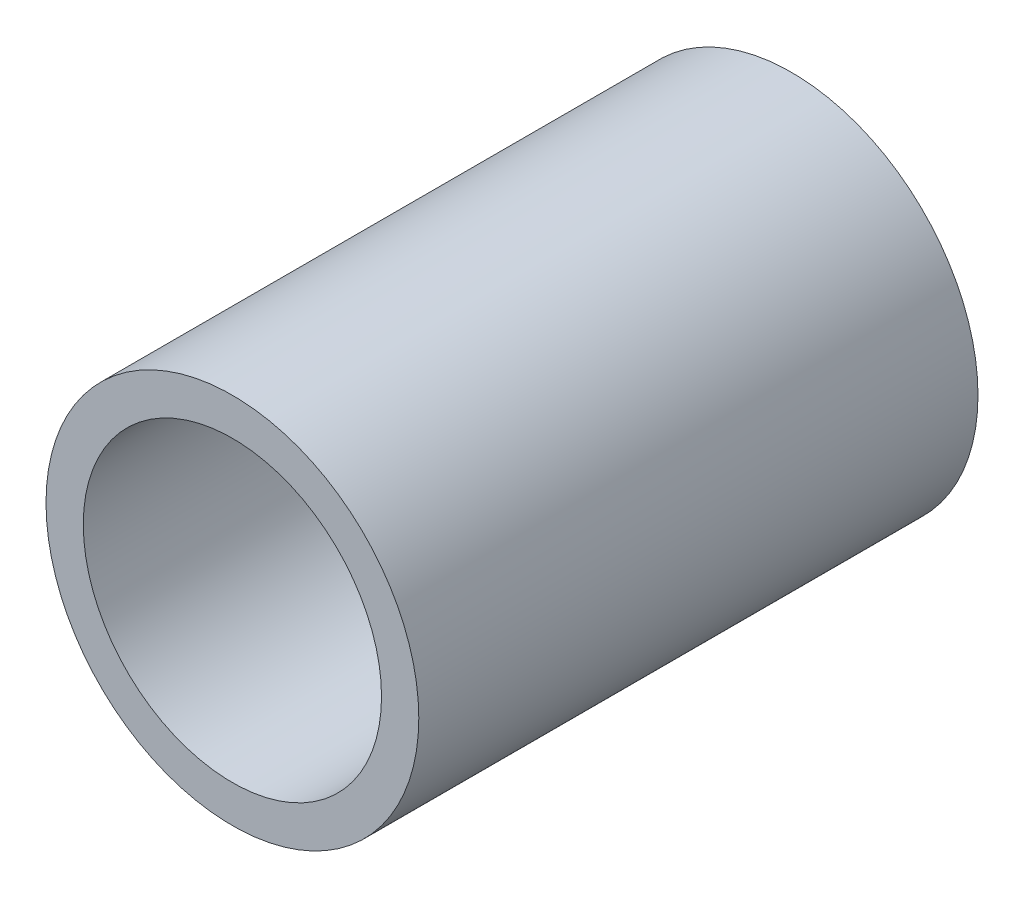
ISO-10303-21;
HEADER;
FILE_DESCRIPTION(('STEP AP214'),'2;1');
FILE_NAME('part.step','',(''),(''),'','','');
FILE_SCHEMA(('AUTOMOTIVE_DESIGN { 1 0 10303 214 1 1 1 1 }'));
ENDSEC;
DATA;
#1=APPLICATION_CONTEXT('core data for automotive mechanical design processes');
#2=APPLICATION_PROTOCOL_DEFINITION('international standard','automotive_design',2000,#1);
#3=PRODUCT_CONTEXT('',#1,'mechanical');
#4=PRODUCT('Part','Part','',(#3));
#5=PRODUCT_RELATED_PRODUCT_CATEGORY('part','',(#4));
#6=PRODUCT_DEFINITION_FORMATION('','',#4);
#7=PRODUCT_DEFINITION_CONTEXT('part definition',#1,'design');
#8=PRODUCT_DEFINITION('design','',#6,#7);
#9=PRODUCT_DEFINITION_SHAPE('','',#8);
#10=(LENGTH_UNIT() NAMED_UNIT(*) SI_UNIT(.MILLI.,.METRE.));
#11=(NAMED_UNIT(*) PLANE_ANGLE_UNIT() SI_UNIT($,.RADIAN.));
#12=(NAMED_UNIT(*) SI_UNIT($,.STERADIAN.) SOLID_ANGLE_UNIT());
#13=UNCERTAINTY_MEASURE_WITH_UNIT(LENGTH_MEASURE(1.E-05),#10,'distance_accuracy_value','');
#14=(GEOMETRIC_REPRESENTATION_CONTEXT(3) GLOBAL_UNCERTAINTY_ASSIGNED_CONTEXT((#13)) GLOBAL_UNIT_ASSIGNED_CONTEXT((#10,
#11,#12)) REPRESENTATION_CONTEXT('',''));
#15=CARTESIAN_POINT('',(0.,0.,0.));
#16=DIRECTION('',(0.,0.,1.));
#17=DIRECTION('',(1.,0.,0.));
#18=AXIS2_PLACEMENT_3D('',#15,#16,#17);
#19=CARTESIAN_POINT('',(0.,0.,60.));
#20=DIRECTION('',(0.,0.,1.00000000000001));
#21=DIRECTION('',(1.00000000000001,0.,0.));
#22=AXIS2_PLACEMENT_3D('',#19,#20,#21);
#23=PLANE('',#22);
#24=CARTESIAN_POINT('',(0.,0.,60.));
#25=DIRECTION('',(0.,0.,1.00000000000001));
#26=DIRECTION('',(1.00000000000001,0.,0.));
#27=AXIS2_PLACEMENT_3D('',#24,#25,#26);
#28=CIRCLE('',#27,20.);
#29=CARTESIAN_POINT('',(20.0000000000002,0.,60.));
#30=VERTEX_POINT('',#29);
#31=EDGE_CURVE('E10',#30,#30,#28,.T.);
#32=ORIENTED_EDGE('',*,*,#31,.T.);
#33=EDGE_LOOP('',(#32));
#34=FACE_BOUND('',#33,.T.);
#35=CARTESIAN_POINT('',(0.,0.,60.));
#36=DIRECTION('',(0.,0.,1.00000000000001));
#37=DIRECTION('',(1.00000000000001,0.,0.));
#38=AXIS2_PLACEMENT_3D('',#35,#36,#37);
#39=CIRCLE('',#38,16.);
#40=CARTESIAN_POINT('',(16.0000000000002,0.,60.));
#41=VERTEX_POINT('',#40);
#42=EDGE_CURVE('E38',#41,#41,#39,.T.);
#43=ORIENTED_EDGE('',*,*,#42,.F.);
#44=EDGE_LOOP('',(#43));
#45=FACE_BOUND('',#44,.T.);
#46=ADVANCED_FACE('F27',(#34,#45),#23,.T.);
#47=CARTESIAN_POINT('',(0.,0.,0.));
#48=DIRECTION('',(0.,0.,1.00000000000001));
#49=DIRECTION('',(1.00000000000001,0.,0.));
#50=AXIS2_PLACEMENT_3D('',#47,#48,#49);
#51=PLANE('',#50);
#52=CARTESIAN_POINT('',(0.,0.,0.));
#53=DIRECTION('',(0.,0.,1.00000000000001));
#54=DIRECTION('',(1.00000000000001,0.,0.));
#55=AXIS2_PLACEMENT_3D('',#52,#53,#54);
#56=CIRCLE('',#55,20.);
#57=CARTESIAN_POINT('',(20.0000000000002,0.,0.));
#58=VERTEX_POINT('',#57);
#59=EDGE_CURVE('E34',#58,#58,#56,.T.);
#60=ORIENTED_EDGE('',*,*,#59,.F.);
#61=EDGE_LOOP('',(#60));
#62=FACE_BOUND('',#61,.T.);
#63=CARTESIAN_POINT('',(0.,0.,0.));
#64=DIRECTION('',(0.,0.,1.00000000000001));
#65=DIRECTION('',(1.00000000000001,0.,0.));
#66=AXIS2_PLACEMENT_3D('',#63,#64,#65);
#67=CIRCLE('',#66,16.);
#68=CARTESIAN_POINT('',(16.0000000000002,0.,0.));
#69=VERTEX_POINT('',#68);
#70=EDGE_CURVE('E42',#69,#69,#67,.T.);
#71=ORIENTED_EDGE('',*,*,#70,.T.);
#72=EDGE_LOOP('',(#71));
#73=FACE_BOUND('',#72,.T.);
#74=ADVANCED_FACE('F48',(#62,#73),#51,.F.);
#75=CARTESIAN_POINT('',(0.,0.,60.));
#76=DIRECTION('',(0.,0.,-1.00000000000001));
#77=DIRECTION('',(-1.00000000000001,0.,0.));
#78=AXIS2_PLACEMENT_3D('',#75,#76,#77);
#79=CYLINDRICAL_SURFACE('',#78,20.);
#80=ORIENTED_EDGE('',*,*,#31,.F.);
#81=EDGE_LOOP('',(#80));
#82=FACE_BOUND('',#81,.T.);
#83=ORIENTED_EDGE('',*,*,#59,.T.);
#84=EDGE_LOOP('',(#83));
#85=FACE_BOUND('',#84,.T.);
#86=ADVANCED_FACE('F29',(#82,#85),#79,.T.);
#87=CARTESIAN_POINT('',(0.,0.,60.));
#88=DIRECTION('',(0.,0.,-1.00000000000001));
#89=DIRECTION('',(-1.00000000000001,0.,0.));
#90=AXIS2_PLACEMENT_3D('',#87,#88,#89);
#91=CYLINDRICAL_SURFACE('',#90,16.);
#92=ORIENTED_EDGE('',*,*,#42,.T.);
#93=EDGE_LOOP('',(#92));
#94=FACE_BOUND('',#93,.T.);
#95=ORIENTED_EDGE('',*,*,#70,.F.);
#96=EDGE_LOOP('',(#95));
#97=FACE_BOUND('',#96,.T.);
#98=ADVANCED_FACE('F50',(#94,#97),#91,.F.);
#99=CLOSED_SHELL('',(#46,#74,#86,#98));
#100=MANIFOLD_SOLID_BREP('B2',#99);
#101=ADVANCED_BREP_SHAPE_REPRESENTATION('',(#18,#100),#14);
#102=SHAPE_DEFINITION_REPRESENTATION(#9,#101);
ENDSEC;
END-ISO-10303-21;
